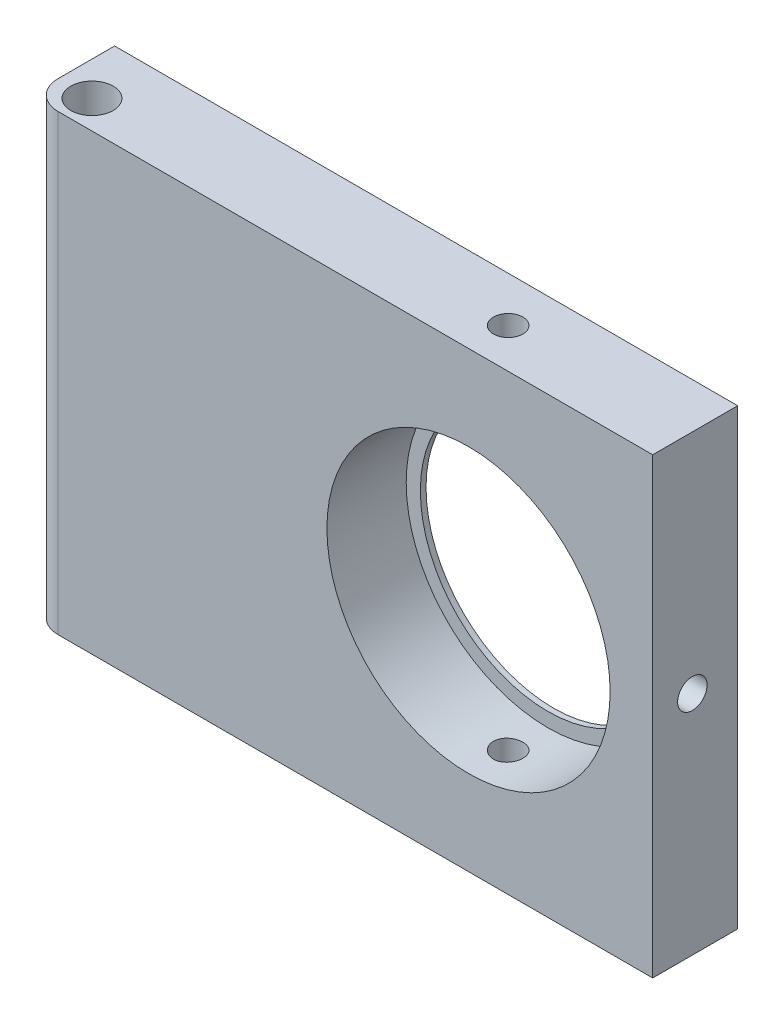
ISO-10303-21;
HEADER;
FILE_DESCRIPTION(('STEP AP214'),'2;1');
FILE_NAME('part.step','',(''),(''),'','','');
FILE_SCHEMA(('AUTOMOTIVE_DESIGN { 1 0 10303 214 1 1 1 1 }'));
ENDSEC;
DATA;
#1=APPLICATION_CONTEXT('core data for automotive mechanical design processes');
#2=APPLICATION_PROTOCOL_DEFINITION('international standard','automotive_design',2000,#1);
#3=PRODUCT_CONTEXT('',#1,'mechanical');
#4=PRODUCT('Part','Part','',(#3));
#5=PRODUCT_RELATED_PRODUCT_CATEGORY('part','',(#4));
#6=PRODUCT_DEFINITION_FORMATION('','',#4);
#7=PRODUCT_DEFINITION_CONTEXT('part definition',#1,'design');
#8=PRODUCT_DEFINITION('design','',#6,#7);
#9=PRODUCT_DEFINITION_SHAPE('','',#8);
#10=(LENGTH_UNIT() NAMED_UNIT(*) SI_UNIT(.MILLI.,.METRE.));
#11=(NAMED_UNIT(*) PLANE_ANGLE_UNIT() SI_UNIT($,.RADIAN.));
#12=(NAMED_UNIT(*) SI_UNIT($,.STERADIAN.) SOLID_ANGLE_UNIT());
#13=UNCERTAINTY_MEASURE_WITH_UNIT(LENGTH_MEASURE(1.E-05),#10,'distance_accuracy_value','');
#14=(GEOMETRIC_REPRESENTATION_CONTEXT(3) GLOBAL_UNCERTAINTY_ASSIGNED_CONTEXT((#13)) GLOBAL_UNIT_ASSIGNED_CONTEXT((#10,
#11,#12)) REPRESENTATION_CONTEXT('',''));
#15=CARTESIAN_POINT('',(0.,0.,0.));
#16=DIRECTION('',(0.,0.,1.));
#17=DIRECTION('',(1.,0.,0.));
#18=AXIS2_PLACEMENT_3D('',#15,#16,#17);
#19=CARTESIAN_POINT('',(-38.1,-25.4,9.525));
#20=DIRECTION('',(-1.,0.,0.));
#21=DIRECTION('',(0.,-1.,0.));
#22=AXIS2_PLACEMENT_3D('',#19,#20,#21);
#23=PLANE('',#22);
#24=DIRECTION('',(0.,0.,-1.));
#25=VECTOR('',#24,1.);
#26=CARTESIAN_POINT('',(-38.1,-25.4,9.525));
#27=LINE('',#26,#25);
#28=CARTESIAN_POINT('',(-38.1,-25.4,6.35));
#29=VERTEX_POINT('',#28);
#30=CARTESIAN_POINT('',(-38.1,-25.4,0.));
#31=VERTEX_POINT('',#30);
#32=EDGE_CURVE('E118',#29,#31,#27,.T.);
#33=ORIENTED_EDGE('',*,*,#32,.F.);
#34=DIRECTION('',(0.,1.,0.));
#35=VECTOR('',#34,1.);
#36=CARTESIAN_POINT('',(-38.1,-25.4,6.35));
#37=LINE('',#36,#35);
#38=CARTESIAN_POINT('',(-38.1,25.4,6.35));
#39=VERTEX_POINT('',#38);
#40=EDGE_CURVE('E87',#29,#39,#37,.T.);
#41=ORIENTED_EDGE('',*,*,#40,.T.);
#42=DIRECTION('',(0.,0.,-1.));
#43=VECTOR('',#42,1.);
#44=CARTESIAN_POINT('',(-38.1,25.4,9.525));
#45=LINE('',#44,#43);
#46=CARTESIAN_POINT('',(-38.1,25.4,0.));
#47=VERTEX_POINT('',#46);
#48=EDGE_CURVE('E81',#39,#47,#45,.T.);
#49=ORIENTED_EDGE('',*,*,#48,.T.);
#50=DIRECTION('',(0.,1.,0.));
#51=VECTOR('',#50,1.);
#52=CARTESIAN_POINT('',(-38.1,-25.4,0.));
#53=LINE('',#52,#51);
#54=EDGE_CURVE('E84',#31,#47,#53,.T.);
#55=ORIENTED_EDGE('',*,*,#54,.F.);
#56=EDGE_LOOP('',(#33,#41,#49,#55));
#57=FACE_BOUND('',#56,.T.);
#58=ADVANCED_FACE('F35',(#57),#23,.T.);
#59=CARTESIAN_POINT('',(-38.1,-25.4,9.525));
#60=DIRECTION('',(0.,1.,0.));
#61=DIRECTION('',(-1.,0.,0.));
#62=AXIS2_PLACEMENT_3D('',#59,#60,#61);
#63=PLANE('',#62);
#64=CARTESIAN_POINT('',(11.0998,-25.4,5.08));
#65=DIRECTION('',(0.,1.,0.));
#66=DIRECTION('',(-1.,0.,0.));
#67=AXIS2_PLACEMENT_3D('',#64,#65,#66);
#68=CIRCLE('',#67,1.651);
#69=CARTESIAN_POINT('',(9.44879999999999,-25.4,5.08));
#70=VERTEX_POINT('',#69);
#71=EDGE_CURVE('E129',#70,#70,#68,.T.);
#72=ORIENTED_EDGE('',*,*,#71,.T.);
#73=EDGE_LOOP('',(#72));
#74=FACE_BOUND('',#73,.T.);
#75=CARTESIAN_POINT('',(-34.29,-25.4,6.35));
#76=DIRECTION('',(0.,-1.,0.));
#77=DIRECTION('',(1.,0.,0.));
#78=AXIS2_PLACEMENT_3D('',#75,#76,#77);
#79=CIRCLE('',#78,2.3749);
#80=CARTESIAN_POINT('',(-31.9151,-25.4,6.35));
#81=VERTEX_POINT('',#80);
#82=EDGE_CURVE('E220',#81,#81,#79,.T.);
#83=ORIENTED_EDGE('',*,*,#82,.F.);
#84=EDGE_LOOP('',(#83));
#85=FACE_BOUND('',#84,.T.);
#86=DIRECTION('',(1.,0.,0.));
#87=VECTOR('',#86,1.);
#88=CARTESIAN_POINT('',(-38.1,-25.4,9.525));
#89=LINE('',#88,#87);
#90=CARTESIAN_POINT('',(-34.925,-25.4,9.525));
#91=VERTEX_POINT('',#90);
#92=CARTESIAN_POINT('',(31.75,-25.4,9.525));
#93=VERTEX_POINT('',#92);
#94=EDGE_CURVE('E90',#91,#93,#89,.T.);
#95=ORIENTED_EDGE('',*,*,#94,.F.);
#96=CARTESIAN_POINT('',(-34.925,-25.4,6.35));
#97=DIRECTION('',(0.,1.,0.));
#98=DIRECTION('',(-1.,0.,0.));
#99=AXIS2_PLACEMENT_3D('',#96,#97,#98);
#100=CIRCLE('',#99,3.175);
#101=EDGE_CURVE('E11',#91,#29,#100,.F.);
#102=ORIENTED_EDGE('',*,*,#101,.T.);
#103=ORIENTED_EDGE('',*,*,#32,.T.);
#104=DIRECTION('',(1.,0.,0.));
#105=VECTOR('',#104,1.);
#106=CARTESIAN_POINT('',(-38.1,-25.4,0.));
#107=LINE('',#106,#105);
#108=CARTESIAN_POINT('',(31.75,-25.4,0.));
#109=VERTEX_POINT('',#108);
#110=EDGE_CURVE('E99',#31,#109,#107,.T.);
#111=ORIENTED_EDGE('',*,*,#110,.T.);
#112=DIRECTION('',(0.,0.,-1.));
#113=VECTOR('',#112,1.);
#114=CARTESIAN_POINT('',(31.75,-25.4,9.525));
#115=LINE('',#114,#113);
#116=EDGE_CURVE('E116',#93,#109,#115,.T.);
#117=ORIENTED_EDGE('',*,*,#116,.F.);
#118=EDGE_LOOP('',(#95,#102,#103,#111,#117));
#119=FACE_BOUND('',#118,.T.);
#120=ADVANCED_FACE('F37',(#74,#85,#119),#63,.F.);
#121=CARTESIAN_POINT('',(31.75,25.4,9.525));
#122=DIRECTION('',(1.,0.,0.));
#123=DIRECTION('',(0.,1.,0.));
#124=AXIS2_PLACEMENT_3D('',#121,#122,#123);
#125=PLANE('',#124);
#126=CARTESIAN_POINT('',(31.75,0.,5.08));
#127=DIRECTION('',(1.,0.,0.));
#128=DIRECTION('',(0.,1.,0.));
#129=AXIS2_PLACEMENT_3D('',#126,#127,#128);
#130=CIRCLE('',#129,1.651);
#131=CARTESIAN_POINT('',(31.75,1.65100000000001,5.08));
#132=VERTEX_POINT('',#131);
#133=EDGE_CURVE('E215',#132,#132,#130,.T.);
#134=ORIENTED_EDGE('',*,*,#133,.F.);
#135=EDGE_LOOP('',(#134));
#136=FACE_BOUND('',#135,.T.);
#137=DIRECTION('',(0.,0.,-1.));
#138=VECTOR('',#137,1.);
#139=CARTESIAN_POINT('',(31.75,25.4,9.525));
#140=LINE('',#139,#138);
#141=CARTESIAN_POINT('',(31.75,25.4,9.525));
#142=VERTEX_POINT('',#141);
#143=CARTESIAN_POINT('',(31.75,25.4,0.));
#144=VERTEX_POINT('',#143);
#145=EDGE_CURVE('E89',#142,#144,#140,.T.);
#146=ORIENTED_EDGE('',*,*,#145,.F.);
#147=DIRECTION('',(0.,-1.,0.));
#148=VECTOR('',#147,1.);
#149=CARTESIAN_POINT('',(31.75,25.4,9.525));
#150=LINE('',#149,#148);
#151=EDGE_CURVE('E111',#142,#93,#150,.T.);
#152=ORIENTED_EDGE('',*,*,#151,.T.);
#153=ORIENTED_EDGE('',*,*,#116,.T.);
#154=DIRECTION('',(0.,-1.,0.));
#155=VECTOR('',#154,1.);
#156=CARTESIAN_POINT('',(31.75,25.4,0.));
#157=LINE('',#156,#155);
#158=EDGE_CURVE('E103',#144,#109,#157,.T.);
#159=ORIENTED_EDGE('',*,*,#158,.F.);
#160=EDGE_LOOP('',(#146,#152,#153,#159));
#161=FACE_BOUND('',#160,.T.);
#162=ADVANCED_FACE('F173',(#136,#161),#125,.T.);
#163=CARTESIAN_POINT('',(31.75,25.4,9.525));
#164=DIRECTION('',(0.,-1.,0.));
#165=DIRECTION('',(1.,0.,0.));
#166=AXIS2_PLACEMENT_3D('',#163,#164,#165);
#167=PLANE('',#166);
#168=CARTESIAN_POINT('',(11.0998,25.4,5.08));
#169=DIRECTION('',(0.,1.,0.));
#170=DIRECTION('',(-1.,0.,0.));
#171=AXIS2_PLACEMENT_3D('',#168,#169,#170);
#172=CIRCLE('',#171,1.651);
#173=CARTESIAN_POINT('',(9.44880000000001,25.4,5.08));
#174=VERTEX_POINT('',#173);
#175=EDGE_CURVE('E214',#174,#174,#172,.T.);
#176=ORIENTED_EDGE('',*,*,#175,.F.);
#177=EDGE_LOOP('',(#176));
#178=FACE_BOUND('',#177,.T.);
#179=CARTESIAN_POINT('',(-34.29,25.4,6.35));
#180=DIRECTION('',(0.,-1.,0.));
#181=DIRECTION('',(1.,0.,0.));
#182=AXIS2_PLACEMENT_3D('',#179,#180,#181);
#183=CIRCLE('',#182,2.3749);
#184=CARTESIAN_POINT('',(-31.9151,25.4,6.35));
#185=VERTEX_POINT('',#184);
#186=EDGE_CURVE('E223',#185,#185,#183,.T.);
#187=ORIENTED_EDGE('',*,*,#186,.T.);
#188=EDGE_LOOP('',(#187));
#189=FACE_BOUND('',#188,.T.);
#190=ORIENTED_EDGE('',*,*,#48,.F.);
#191=CARTESIAN_POINT('',(-34.925,25.4,6.35));
#192=DIRECTION('',(0.,-1.,0.));
#193=DIRECTION('',(1.,0.,0.));
#194=AXIS2_PLACEMENT_3D('',#191,#192,#193);
#195=CIRCLE('',#194,3.175);
#196=CARTESIAN_POINT('',(-34.925,25.4,9.525));
#197=VERTEX_POINT('',#196);
#198=EDGE_CURVE('E57',#39,#197,#195,.F.);
#199=ORIENTED_EDGE('',*,*,#198,.T.);
#200=DIRECTION('',(-1.,0.,0.));
#201=VECTOR('',#200,1.);
#202=CARTESIAN_POINT('',(31.75,25.4,9.525));
#203=LINE('',#202,#201);
#204=EDGE_CURVE('E109',#142,#197,#203,.T.);
#205=ORIENTED_EDGE('',*,*,#204,.F.);
#206=ORIENTED_EDGE('',*,*,#145,.T.);
#207=DIRECTION('',(-1.,0.,0.));
#208=VECTOR('',#207,1.);
#209=CARTESIAN_POINT('',(31.75,25.4,0.));
#210=LINE('',#209,#208);
#211=EDGE_CURVE('E96',#144,#47,#210,.T.);
#212=ORIENTED_EDGE('',*,*,#211,.T.);
#213=EDGE_LOOP('',(#190,#199,#205,#206,#212));
#214=FACE_BOUND('',#213,.T.);
#215=ADVANCED_FACE('F102',(#178,#189,#214),#167,.F.);
#216=CARTESIAN_POINT('',(-38.1,25.4,9.525));
#217=DIRECTION('',(0.,0.,1.));
#218=DIRECTION('',(1.,0.,0.));
#219=AXIS2_PLACEMENT_3D('',#216,#217,#218);
#220=PLANE('',#219);
#221=CARTESIAN_POINT('',(11.0998,0.,9.525));
#222=DIRECTION('',(0.,0.,1.));
#223=DIRECTION('',(1.,0.,0.));
#224=AXIS2_PLACEMENT_3D('',#221,#222,#223);
#225=CIRCLE('',#224,15.875);
#226=CARTESIAN_POINT('',(26.9748,0.,9.525));
#227=VERTEX_POINT('',#226);
#228=EDGE_CURVE('E191',#227,#227,#225,.T.);
#229=ORIENTED_EDGE('',*,*,#228,.F.);
#230=EDGE_LOOP('',(#229));
#231=FACE_BOUND('',#230,.T.);
#232=ORIENTED_EDGE('',*,*,#204,.T.);
#233=DIRECTION('',(0.,1.,0.));
#234=VECTOR('',#233,1.);
#235=CARTESIAN_POINT('',(-34.925,25.4,9.525));
#236=LINE('',#235,#234);
#237=EDGE_CURVE('E43',#197,#91,#236,.F.);
#238=ORIENTED_EDGE('',*,*,#237,.T.);
#239=ORIENTED_EDGE('',*,*,#94,.T.);
#240=ORIENTED_EDGE('',*,*,#151,.F.);
#241=EDGE_LOOP('',(#232,#238,#239,#240));
#242=FACE_BOUND('',#241,.T.);
#243=ADVANCED_FACE('F166',(#231,#242),#220,.T.);
#244=CARTESIAN_POINT('',(-38.1,25.4,0.));
#245=DIRECTION('',(0.,0.,1.));
#246=DIRECTION('',(1.,0.,0.));
#247=AXIS2_PLACEMENT_3D('',#244,#245,#246);
#248=PLANE('',#247);
#249=CARTESIAN_POINT('',(11.0998,0.,0.));
#250=DIRECTION('',(0.,0.,1.));
#251=DIRECTION('',(1.,0.,0.));
#252=AXIS2_PLACEMENT_3D('',#249,#250,#251);
#253=CIRCLE('',#252,14.2875);
#254=CARTESIAN_POINT('',(25.3873,0.,0.));
#255=VERTEX_POINT('',#254);
#256=EDGE_CURVE('E229',#255,#255,#253,.T.);
#257=ORIENTED_EDGE('',*,*,#256,.T.);
#258=EDGE_LOOP('',(#257));
#259=FACE_BOUND('',#258,.T.);
#260=ORIENTED_EDGE('',*,*,#54,.T.);
#261=ORIENTED_EDGE('',*,*,#211,.F.);
#262=ORIENTED_EDGE('',*,*,#158,.T.);
#263=ORIENTED_EDGE('',*,*,#110,.F.);
#264=EDGE_LOOP('',(#260,#261,#262,#263));
#265=FACE_BOUND('',#264,.T.);
#266=ADVANCED_FACE('F94',(#259,#265),#248,.F.);
#267=CARTESIAN_POINT('',(11.0998,0.,0.635000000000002));
#268=DIRECTION('',(0.,0.,1.));
#269=DIRECTION('',(1.,0.,0.));
#270=AXIS2_PLACEMENT_3D('',#267,#268,#269);
#271=CYLINDRICAL_SURFACE('',#270,15.875);
#272=CARTESIAN_POINT('',(26.8887145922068,1.65100000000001,5.08));
#273=CARTESIAN_POINT('',(26.8887157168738,1.65099600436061,4.98753205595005));
#274=CARTESIAN_POINT('',(26.8895356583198,1.64320551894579,4.89500345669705));
#275=CARTESIAN_POINT('',(26.8927262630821,1.61224621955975,4.71251305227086));
#276=CARTESIAN_POINT('',(26.8950986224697,1.58906058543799,4.62255416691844));
#277=CARTESIAN_POINT('',(26.9011225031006,1.52799466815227,4.44787226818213));
#278=CARTESIAN_POINT('',(26.9047732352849,1.49012344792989,4.36314606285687));
#279=CARTESIAN_POINT('',(26.9129415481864,1.40077910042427,4.20127051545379));
#280=CARTESIAN_POINT('',(26.9174589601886,1.34930861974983,4.12411970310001));
#281=CARTESIAN_POINT('',(26.9268714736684,1.23401012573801,3.97926454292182));
#282=CARTESIAN_POINT('',(26.9317678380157,1.17013961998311,3.91159409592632));
#283=CARTESIAN_POINT('',(26.9413751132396,1.03194505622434,3.78791264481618));
#284=CARTESIAN_POINT('',(26.9460860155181,0.957620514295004,3.73190218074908));
#285=CARTESIAN_POINT('',(26.9548041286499,0.80041907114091,3.63301269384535));
#286=CARTESIAN_POINT('',(26.9588097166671,0.717523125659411,3.59016378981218));
#287=CARTESIAN_POINT('',(26.9656521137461,0.545664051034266,3.51900646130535));
#288=CARTESIAN_POINT('',(26.9684889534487,0.456701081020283,3.49069765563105));
#289=CARTESIAN_POINT('',(26.972665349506,0.275576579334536,3.44952385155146));
#290=CARTESIAN_POINT('',(26.9740103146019,0.183427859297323,3.43660305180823));
#291=CARTESIAN_POINT('',(26.9750698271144,-0.00173930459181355,3.42639933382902));
#292=CARTESIAN_POINT('',(26.9747844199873,-0.0947577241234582,3.4291159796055));
#293=CARTESIAN_POINT('',(26.9726197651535,-0.278644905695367,3.45006482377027));
#294=CARTESIAN_POINT('',(26.9707466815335,-0.369520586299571,3.4682370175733));
#295=CARTESIAN_POINT('',(26.9656242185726,-0.546925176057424,3.51948759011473));
#296=CARTESIAN_POINT('',(26.9623748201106,-0.633454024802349,3.55256617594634));
#297=CARTESIAN_POINT('',(26.9548544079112,-0.799897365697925,3.63275605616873));
#298=CARTESIAN_POINT('',(26.9505814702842,-0.879799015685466,3.6798938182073));
#299=CARTESIAN_POINT('',(26.9414932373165,-1.0305797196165,3.78684475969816));
#300=CARTESIAN_POINT('',(26.9366779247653,-1.10145848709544,3.84665834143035));
#301=CARTESIAN_POINT('',(26.9270182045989,-1.23253305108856,3.97760030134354));
#302=CARTESIAN_POINT('',(26.9221737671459,-1.29267669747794,4.04878089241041));
#303=CARTESIAN_POINT('',(26.9130245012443,-1.40016979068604,4.20025553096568));
#304=CARTESIAN_POINT('',(26.9087196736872,-1.44751921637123,4.28054959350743));
#305=CARTESIAN_POINT('',(26.9011367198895,-1.52808000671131,4.4480129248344));
#306=CARTESIAN_POINT('',(26.8978588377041,-1.56128801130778,4.53518382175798));
#307=CARTESIAN_POINT('',(26.8927059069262,-1.61258131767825,4.71390592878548));
#308=CARTESIAN_POINT('',(26.890830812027,-1.63066711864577,4.80545699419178));
#309=CARTESIAN_POINT('',(26.8887038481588,-1.65113525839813,4.98988241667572));
#310=CARTESIAN_POINT('',(26.8884444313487,-1.65359061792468,5.08274858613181));
#311=CARTESIAN_POINT('',(26.8895582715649,-1.64292007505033,5.26757022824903));
#312=CARTESIAN_POINT('',(26.8909315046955,-1.62979440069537,5.35952571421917));
#313=CARTESIAN_POINT('',(26.8951490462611,-1.58839552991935,5.53970199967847));
#314=CARTESIAN_POINT('',(26.8979899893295,-1.56015698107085,5.62793084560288));
#315=CARTESIAN_POINT('',(26.9048201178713,-1.48936936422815,5.79839970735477));
#316=CARTESIAN_POINT('',(26.9088093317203,-1.44681994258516,5.88063957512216));
#317=CARTESIAN_POINT('',(26.9175047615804,-1.34843597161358,6.03712846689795));
#318=CARTESIAN_POINT('',(26.9222135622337,-1.29255310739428,6.11134696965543));
#319=CARTESIAN_POINT('',(26.931809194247,-1.16915767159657,6.24937655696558));
#320=CARTESIAN_POINT('',(26.9366960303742,-1.10164478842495,6.31318736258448));
#321=CARTESIAN_POINT('',(26.9461199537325,-0.95658865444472,6.42884269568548));
#322=CARTESIAN_POINT('',(26.9506556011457,-0.879007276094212,6.48063953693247));
#323=CARTESIAN_POINT('',(26.9588450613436,-0.716204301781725,6.5704682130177));
#324=CARTESIAN_POINT('',(26.9624988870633,-0.630982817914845,6.60850024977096));
#325=CARTESIAN_POINT('',(26.9685065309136,-0.45548404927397,6.66963922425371));
#326=CARTESIAN_POINT('',(26.970862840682,-0.365216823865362,6.69277478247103));
#327=CARTESIAN_POINT('',(26.9740202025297,-0.182053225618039,6.72355743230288));
#328=CARTESIAN_POINT('',(26.9748213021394,-0.0891569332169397,6.73120499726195));
#329=CARTESIAN_POINT('',(26.9747779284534,0.0961598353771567,6.73078760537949));
#330=CARTESIAN_POINT('',(26.973941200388,0.188580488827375,6.72279660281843));
#331=CARTESIAN_POINT('',(26.9707314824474,0.370758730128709,6.69148421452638));
#332=CARTESIAN_POINT('',(26.9683584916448,0.460516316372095,6.66816281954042));
#333=CARTESIAN_POINT('',(26.9623420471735,0.634818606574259,6.60687255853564));
#334=CARTESIAN_POINT('',(26.9586987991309,0.719364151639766,6.56890606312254));
#335=CARTESIAN_POINT('',(26.950547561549,0.880894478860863,6.47941114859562));
#336=CARTESIAN_POINT('',(26.946039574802,0.957879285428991,6.42788277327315));
#337=CARTESIAN_POINT('',(26.9366381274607,1.10248172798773,6.3124498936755));
#338=CARTESIAN_POINT('',(26.9317430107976,1.17005528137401,6.24849030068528));
#339=CARTESIAN_POINT('',(26.9221329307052,1.29354262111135,6.11012048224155));
#340=CARTESIAN_POINT('',(26.9174180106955,1.34945361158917,6.03570775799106));
#341=CARTESIAN_POINT('',(26.9086884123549,1.44815099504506,5.87831976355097));
#342=CARTESIAN_POINT('',(26.9046756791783,1.49090117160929,5.79532169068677));
#343=CARTESIAN_POINT('',(26.8978278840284,1.56180032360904,5.62333537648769));
#344=CARTESIAN_POINT('',(26.8949915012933,1.5899656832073,5.53435398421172));
#345=CARTESIAN_POINT('',(26.8915290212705,1.62391250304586,5.38406228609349));
#346=CARTESIAN_POINT('',(26.8904786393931,1.63405632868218,5.32371112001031));
#347=CARTESIAN_POINT('',(26.8890710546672,1.64760138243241,5.20224880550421));
#348=CARTESIAN_POINT('',(26.888713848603,1.65100264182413,5.14113766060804));
#349=CARTESIAN_POINT('',(26.8887145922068,1.65100000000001,5.08));
#350=B_SPLINE_CURVE_WITH_KNOTS('',3,(#272,#273,#274,#275,#276,#277,#278,#279,#280,#281,#282,
#283,#284,#285,#286,#287,#288,#289,#290,#291,#292,#293,#294,#295,#296,#297,#298,#299,#300,#301,
#302,#303,#304,#305,#306,#307,#308,#309,#310,#311,#312,#313,#314,#315,#316,#317,#318,#319,#320,
#321,#322,#323,#324,#325,#326,#327,#328,#329,#330,#331,#332,#333,#334,#335,#336,#337,#338,#339,
#340,#341,#342,#343,#344,#345,#346,#347,#348,#349),.UNSPECIFIED.,.T.,.F.,(4,2,2,2,2,2,2,2,2,2,2,
2,2,2,2,2,2,2,2,2,2,2,2,2,2,2,2,2,2,2,2,2,2,2,2,2,2,2,4),(0.,0.277180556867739,
0.554664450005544,0.831977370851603,1.10923636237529,1.3874627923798,1.66570210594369,
1.94457347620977,2.22343753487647,2.50128724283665,2.77912920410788,3.0558973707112,
3.33266938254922,3.60996576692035,3.8872709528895,4.16588862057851,4.44450674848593,
4.72319104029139,5.00186613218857,5.27923837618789,5.55660656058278,5.83334156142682,
6.11008340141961,6.3878436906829,6.66561142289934,6.94446350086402,7.22331148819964,
7.50162211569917,7.77992423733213,8.05691345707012,8.3339028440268,8.61084741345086,
8.88779108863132,9.16599123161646,9.44425799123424,9.72328378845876,10.0019954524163,
10.1852616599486,10.3685270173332),.UNSPECIFIED.);
#351=CARTESIAN_POINT('',(26.8887145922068,1.65100000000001,5.08));
#352=VERTEX_POINT('',#351);
#353=EDGE_CURVE('E207',#352,#352,#350,.T.);
#354=ORIENTED_EDGE('',*,*,#353,.F.);
#355=EDGE_LOOP('',(#354));
#356=FACE_BOUND('',#355,.T.);
#357=CARTESIAN_POINT('',(9.44879999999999,-15.7889145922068,5.08));
#358=CARTESIAN_POINT('',(9.44880399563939,-15.7889157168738,4.98753205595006));
#359=CARTESIAN_POINT('',(9.45659448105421,-15.7897356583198,4.89500345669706));
#360=CARTESIAN_POINT('',(9.48755378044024,-15.7929262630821,4.71251305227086));
#361=CARTESIAN_POINT('',(9.51073941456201,-15.7952986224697,4.62255416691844));
#362=CARTESIAN_POINT('',(9.57180533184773,-15.8013225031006,4.44787226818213));
#363=CARTESIAN_POINT('',(9.60967655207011,-15.8049732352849,4.36314606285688));
#364=CARTESIAN_POINT('',(9.69902089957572,-15.8131415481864,4.20127051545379));
#365=CARTESIAN_POINT('',(9.75049138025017,-15.8176589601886,4.12411970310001));
#366=CARTESIAN_POINT('',(9.86578987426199,-15.8270714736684,3.97926454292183));
#367=CARTESIAN_POINT('',(9.92966038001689,-15.8319678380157,3.91159409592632));
#368=CARTESIAN_POINT('',(10.0678549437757,-15.8415751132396,3.78791264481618));
#369=CARTESIAN_POINT('',(10.142179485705,-15.8462860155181,3.73190218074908));
#370=CARTESIAN_POINT('',(10.2993809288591,-15.8550041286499,3.63301269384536));
#371=CARTESIAN_POINT('',(10.3822768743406,-15.8590097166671,3.59016378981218));
#372=CARTESIAN_POINT('',(10.5541359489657,-15.8658521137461,3.51900646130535));
#373=CARTESIAN_POINT('',(10.6430989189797,-15.8686889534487,3.49069765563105));
#374=CARTESIAN_POINT('',(10.8242234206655,-15.8728653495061,3.44952385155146));
#375=CARTESIAN_POINT('',(10.9163721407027,-15.8742103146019,3.43660305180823));
#376=CARTESIAN_POINT('',(11.1015393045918,-15.8752698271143,3.42639933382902));
#377=CARTESIAN_POINT('',(11.1945577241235,-15.8749844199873,3.4291159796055));
#378=CARTESIAN_POINT('',(11.3784449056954,-15.8728197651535,3.45006482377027));
#379=CARTESIAN_POINT('',(11.4693205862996,-15.8709466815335,3.4682370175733));
#380=CARTESIAN_POINT('',(11.6467251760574,-15.8658242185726,3.51948759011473));
#381=CARTESIAN_POINT('',(11.7332540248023,-15.8625748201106,3.55256617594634));
#382=CARTESIAN_POINT('',(11.8996973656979,-15.8550544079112,3.63275605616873));
#383=CARTESIAN_POINT('',(11.9795990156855,-15.8507814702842,3.6798938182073));
#384=CARTESIAN_POINT('',(12.1303797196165,-15.8416932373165,3.78684475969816));
#385=CARTESIAN_POINT('',(12.2012584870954,-15.8368779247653,3.84665834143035));
#386=CARTESIAN_POINT('',(12.3323330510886,-15.8272182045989,3.97760030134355));
#387=CARTESIAN_POINT('',(12.3924766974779,-15.8223737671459,4.04878089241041));
#388=CARTESIAN_POINT('',(12.499969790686,-15.8132245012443,4.20025553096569));
#389=CARTESIAN_POINT('',(12.5473192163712,-15.8089196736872,4.28054959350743));
#390=CARTESIAN_POINT('',(12.6278800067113,-15.8013367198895,4.44801292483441));
#391=CARTESIAN_POINT('',(12.6610880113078,-15.798058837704,4.53518382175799));
#392=CARTESIAN_POINT('',(12.7123813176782,-15.7929059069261,4.71390592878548));
#393=CARTESIAN_POINT('',(12.7304671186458,-15.791030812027,4.80545699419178));
#394=CARTESIAN_POINT('',(12.7509352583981,-15.7889038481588,4.98988241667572));
#395=CARTESIAN_POINT('',(12.7533906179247,-15.7886444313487,5.08274858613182));
#396=CARTESIAN_POINT('',(12.7427200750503,-15.7897582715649,5.26757022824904));
#397=CARTESIAN_POINT('',(12.7295944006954,-15.7911315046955,5.35952571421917));
#398=CARTESIAN_POINT('',(12.6881955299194,-15.7953490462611,5.53970199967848));
#399=CARTESIAN_POINT('',(12.6599569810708,-15.7981899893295,5.62793084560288));
#400=CARTESIAN_POINT('',(12.5891693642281,-15.8050201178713,5.79839970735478));
#401=CARTESIAN_POINT('',(12.5466199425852,-15.8090093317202,5.88063957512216));
#402=CARTESIAN_POINT('',(12.4482359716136,-15.8177047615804,6.03712846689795));
#403=CARTESIAN_POINT('',(12.3923531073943,-15.8224135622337,6.11134696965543));
#404=CARTESIAN_POINT('',(12.2689576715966,-15.832009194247,6.24937655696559));
#405=CARTESIAN_POINT('',(12.201444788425,-15.8368960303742,6.31318736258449));
#406=CARTESIAN_POINT('',(12.0563886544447,-15.8463199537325,6.42884269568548));
#407=CARTESIAN_POINT('',(11.9788072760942,-15.8508556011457,6.48063953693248));
#408=CARTESIAN_POINT('',(11.8160043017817,-15.8590450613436,6.5704682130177));
#409=CARTESIAN_POINT('',(11.7307828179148,-15.8626988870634,6.60850024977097));
#410=CARTESIAN_POINT('',(11.555284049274,-15.8687065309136,6.66963922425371));
#411=CARTESIAN_POINT('',(11.4650168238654,-15.871062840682,6.69277478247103));
#412=CARTESIAN_POINT('',(11.281853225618,-15.8742202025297,6.72355743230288));
#413=CARTESIAN_POINT('',(11.1889569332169,-15.8750213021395,6.73120499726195));
#414=CARTESIAN_POINT('',(11.0036401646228,-15.8749779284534,6.73078760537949));
#415=CARTESIAN_POINT('',(10.9112195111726,-15.874141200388,6.72279660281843));
#416=CARTESIAN_POINT('',(10.7290412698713,-15.8709314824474,6.69148421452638));
#417=CARTESIAN_POINT('',(10.6392836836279,-15.8685584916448,6.66816281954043));
#418=CARTESIAN_POINT('',(10.4649813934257,-15.8625420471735,6.60687255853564));
#419=CARTESIAN_POINT('',(10.3804358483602,-15.8588987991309,6.56890606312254));
#420=CARTESIAN_POINT('',(10.2189055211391,-15.850747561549,6.47941114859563));
#421=CARTESIAN_POINT('',(10.141920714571,-15.846239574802,6.42788277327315));
#422=CARTESIAN_POINT('',(9.99731827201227,-15.8368381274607,6.3124498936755));
#423=CARTESIAN_POINT('',(9.92974471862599,-15.8319430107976,6.24849030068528));
#424=CARTESIAN_POINT('',(9.80625737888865,-15.8223329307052,6.11012048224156));
#425=CARTESIAN_POINT('',(9.75034638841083,-15.8176180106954,6.03570775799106));
#426=CARTESIAN_POINT('',(9.65164900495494,-15.8088884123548,5.87831976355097));
#427=CARTESIAN_POINT('',(9.60889882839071,-15.8048756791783,5.79532169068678));
#428=CARTESIAN_POINT('',(9.53799967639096,-15.7980278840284,5.62333537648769));
#429=CARTESIAN_POINT('',(9.50983431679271,-15.7951915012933,5.53435398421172));
#430=CARTESIAN_POINT('',(9.47588749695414,-15.7917290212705,5.38406228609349));
#431=CARTESIAN_POINT('',(9.46574367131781,-15.7906786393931,5.32371112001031));
#432=CARTESIAN_POINT('',(9.45219861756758,-15.7892710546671,5.20224880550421));
#433=CARTESIAN_POINT('',(9.44879735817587,-15.788913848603,5.14113766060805));
#434=CARTESIAN_POINT('',(9.44879999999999,-15.7889145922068,5.08));
#435=B_SPLINE_CURVE_WITH_KNOTS('',3,(#357,#358,#359,#360,#361,#362,#363,#364,#365,#366,#367,
#368,#369,#370,#371,#372,#373,#374,#375,#376,#377,#378,#379,#380,#381,#382,#383,#384,#385,#386,
#387,#388,#389,#390,#391,#392,#393,#394,#395,#396,#397,#398,#399,#400,#401,#402,#403,#404,#405,
#406,#407,#408,#409,#410,#411,#412,#413,#414,#415,#416,#417,#418,#419,#420,#421,#422,#423,#424,
#425,#426,#427,#428,#429,#430,#431,#432,#433,#434),.UNSPECIFIED.,.T.,.F.,(4,2,2,2,2,2,2,2,2,2,2,
2,2,2,2,2,2,2,2,2,2,2,2,2,2,2,2,2,2,2,2,2,2,2,2,2,2,2,4),(0.,0.277180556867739,
0.554664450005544,0.831977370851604,1.1092363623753,1.3874627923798,1.66570210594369,
1.94457347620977,2.22343753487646,2.50128724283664,2.77912920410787,3.0558973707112,
3.33266938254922,3.60996576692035,3.8872709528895,4.16588862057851,4.44450674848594,
4.72319104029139,5.00186613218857,5.27923837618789,5.55660656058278,5.83334156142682,
6.11008340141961,6.38784369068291,6.66561142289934,6.94446350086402,7.22331148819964,
7.50162211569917,7.77992423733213,8.05691345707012,8.3339028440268,8.61084741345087,
8.88779108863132,9.16599123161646,9.44425799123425,9.72328378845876,10.0019954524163,
10.1852616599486,10.3685270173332),.UNSPECIFIED.);
#436=CARTESIAN_POINT('',(9.44879999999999,-15.7889145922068,5.08));
#437=VERTEX_POINT('',#436);
#438=EDGE_CURVE('E128',#437,#437,#435,.T.);
#439=ORIENTED_EDGE('',*,*,#438,.T.);
#440=EDGE_LOOP('',(#439));
#441=FACE_BOUND('',#440,.T.);
#442=CARTESIAN_POINT('',(9.44879999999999,15.7889145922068,5.08));
#443=CARTESIAN_POINT('',(9.44880399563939,15.7889157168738,5.17246794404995));
#444=CARTESIAN_POINT('',(9.45659448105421,15.7897356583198,5.26499654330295));
#445=CARTESIAN_POINT('',(9.48755378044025,15.7929262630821,5.44748694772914));
#446=CARTESIAN_POINT('',(9.51073941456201,15.7952986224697,5.53744583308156));
#447=CARTESIAN_POINT('',(9.57180533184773,15.8013225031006,5.71212773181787));
#448=CARTESIAN_POINT('',(9.60967655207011,15.8049732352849,5.79685393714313));
#449=CARTESIAN_POINT('',(9.69902089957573,15.8131415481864,5.95872948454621));
#450=CARTESIAN_POINT('',(9.75049138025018,15.8176589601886,6.03588029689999));
#451=CARTESIAN_POINT('',(9.865789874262,15.8270714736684,6.18073545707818));
#452=CARTESIAN_POINT('',(9.9296603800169,15.8319678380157,6.24840590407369));
#453=CARTESIAN_POINT('',(10.0678549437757,15.8415751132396,6.37208735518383));
#454=CARTESIAN_POINT('',(10.142179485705,15.8462860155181,6.42809781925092));
#455=CARTESIAN_POINT('',(10.2993809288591,15.8550041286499,6.52698730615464));
#456=CARTESIAN_POINT('',(10.3822768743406,15.8590097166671,6.56983621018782));
#457=CARTESIAN_POINT('',(10.5541359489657,15.8658521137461,6.64099353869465));
#458=CARTESIAN_POINT('',(10.6430989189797,15.8686889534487,6.66930234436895));
#459=CARTESIAN_POINT('',(10.8242234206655,15.8728653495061,6.71047614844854));
#460=CARTESIAN_POINT('',(10.9163721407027,15.8742103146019,6.72339694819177));
#461=CARTESIAN_POINT('',(11.1015393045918,15.8752698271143,6.73360066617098));
#462=CARTESIAN_POINT('',(11.1945577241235,15.8749844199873,6.7308840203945));
#463=CARTESIAN_POINT('',(11.3784449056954,15.8728197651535,6.70993517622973));
#464=CARTESIAN_POINT('',(11.4693205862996,15.8709466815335,6.6917629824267));
#465=CARTESIAN_POINT('',(11.6467251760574,15.8658242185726,6.64051240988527));
#466=CARTESIAN_POINT('',(11.7332540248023,15.8625748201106,6.60743382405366));
#467=CARTESIAN_POINT('',(11.8996973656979,15.8550544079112,6.52724394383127));
#468=CARTESIAN_POINT('',(11.9795990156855,15.8507814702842,6.48010618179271));
#469=CARTESIAN_POINT('',(12.1303797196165,15.8416932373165,6.37315524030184));
#470=CARTESIAN_POINT('',(12.2012584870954,15.8368779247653,6.31334165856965));
#471=CARTESIAN_POINT('',(12.3323330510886,15.8272182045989,6.18239969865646));
#472=CARTESIAN_POINT('',(12.3924766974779,15.8223737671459,6.11121910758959));
#473=CARTESIAN_POINT('',(12.499969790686,15.8132245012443,5.95974446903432));
#474=CARTESIAN_POINT('',(12.5473192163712,15.8089196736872,5.87945040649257));
#475=CARTESIAN_POINT('',(12.6278800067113,15.8013367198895,5.7119870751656));
#476=CARTESIAN_POINT('',(12.6610880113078,15.7980588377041,5.62481617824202));
#477=CARTESIAN_POINT('',(12.7123813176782,15.7929059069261,5.44609407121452));
#478=CARTESIAN_POINT('',(12.7304671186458,15.791030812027,5.35454300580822));
#479=CARTESIAN_POINT('',(12.7509352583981,15.7889038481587,5.17011758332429));
#480=CARTESIAN_POINT('',(12.7533906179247,15.7886444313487,5.07725141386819));
#481=CARTESIAN_POINT('',(12.7427200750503,15.7897582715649,4.89242977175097));
#482=CARTESIAN_POINT('',(12.7295944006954,15.7911315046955,4.80047428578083));
#483=CARTESIAN_POINT('',(12.6881955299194,15.7953490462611,4.62029800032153));
#484=CARTESIAN_POINT('',(12.6599569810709,15.7981899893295,4.53206915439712));
#485=CARTESIAN_POINT('',(12.5891693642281,15.8050201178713,4.36160029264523));
#486=CARTESIAN_POINT('',(12.5466199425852,15.8090093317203,4.27936042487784));
#487=CARTESIAN_POINT('',(12.4482359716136,15.8177047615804,4.12287153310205));
#488=CARTESIAN_POINT('',(12.3923531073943,15.8224135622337,4.04865303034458));
#489=CARTESIAN_POINT('',(12.2689576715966,15.832009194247,3.91062344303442));
#490=CARTESIAN_POINT('',(12.201444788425,15.8368960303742,3.84681263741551));
#491=CARTESIAN_POINT('',(12.0563886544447,15.8463199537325,3.73115730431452));
#492=CARTESIAN_POINT('',(11.9788072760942,15.8508556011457,3.67936046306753));
#493=CARTESIAN_POINT('',(11.8160043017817,15.8590450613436,3.58953178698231));
#494=CARTESIAN_POINT('',(11.7307828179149,15.8626988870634,3.55149975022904));
#495=CARTESIAN_POINT('',(11.555284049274,15.8687065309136,3.49036077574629));
#496=CARTESIAN_POINT('',(11.4650168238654,15.871062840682,3.46722521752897));
#497=CARTESIAN_POINT('',(11.281853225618,15.8742202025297,3.43644256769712));
#498=CARTESIAN_POINT('',(11.1889569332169,15.8750213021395,3.42879500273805));
#499=CARTESIAN_POINT('',(11.0036401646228,15.8749779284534,3.42921239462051));
#500=CARTESIAN_POINT('',(10.9112195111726,15.874141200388,3.43720339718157));
#501=CARTESIAN_POINT('',(10.7290412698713,15.8709314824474,3.46851578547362));
#502=CARTESIAN_POINT('',(10.6392836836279,15.8685584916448,3.49183718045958));
#503=CARTESIAN_POINT('',(10.4649813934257,15.8625420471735,3.55312744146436));
#504=CARTESIAN_POINT('',(10.3804358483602,15.8588987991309,3.59109393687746));
#505=CARTESIAN_POINT('',(10.2189055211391,15.850747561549,3.68058885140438));
#506=CARTESIAN_POINT('',(10.141920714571,15.846239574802,3.73211722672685));
#507=CARTESIAN_POINT('',(9.99731827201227,15.8368381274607,3.8475501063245));
#508=CARTESIAN_POINT('',(9.92974471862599,15.8319430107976,3.91150969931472));
#509=CARTESIAN_POINT('',(9.80625737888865,15.8223329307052,4.04987951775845));
#510=CARTESIAN_POINT('',(9.75034638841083,15.8176180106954,4.12429224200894));
#511=CARTESIAN_POINT('',(9.65164900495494,15.8088884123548,4.28168023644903));
#512=CARTESIAN_POINT('',(9.60889882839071,15.8048756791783,4.36467830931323));
#513=CARTESIAN_POINT('',(9.53799967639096,15.7980278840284,4.53666462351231));
#514=CARTESIAN_POINT('',(9.5098343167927,15.7951915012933,4.62564601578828));
#515=CARTESIAN_POINT('',(9.47588749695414,15.7917290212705,4.77593771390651));
#516=CARTESIAN_POINT('',(9.46574367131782,15.7906786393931,4.83628887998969));
#517=CARTESIAN_POINT('',(9.45219861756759,15.7892710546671,4.95775119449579));
#518=CARTESIAN_POINT('',(9.44879735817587,15.788913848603,5.01886233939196));
#519=CARTESIAN_POINT('',(9.44879999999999,15.7889145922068,5.08));
#520=B_SPLINE_CURVE_WITH_KNOTS('',3,(#442,#443,#444,#445,#446,#447,#448,#449,#450,#451,#452,
#453,#454,#455,#456,#457,#458,#459,#460,#461,#462,#463,#464,#465,#466,#467,#468,#469,#470,#471,
#472,#473,#474,#475,#476,#477,#478,#479,#480,#481,#482,#483,#484,#485,#486,#487,#488,#489,#490,
#491,#492,#493,#494,#495,#496,#497,#498,#499,#500,#501,#502,#503,#504,#505,#506,#507,#508,#509,
#510,#511,#512,#513,#514,#515,#516,#517,#518,#519),.UNSPECIFIED.,.T.,.F.,(4,2,2,2,2,2,2,2,2,2,2,
2,2,2,2,2,2,2,2,2,2,2,2,2,2,2,2,2,2,2,2,2,2,2,2,2,2,2,4),(0.,0.27718055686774,0.554664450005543,
0.831977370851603,1.1092363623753,1.3874627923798,1.6657021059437,1.94457347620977,
2.22343753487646,2.50128724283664,2.77912920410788,3.0558973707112,3.33266938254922,
3.60996576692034,3.88727095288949,4.16588862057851,4.44450674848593,4.72319104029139,
5.00186613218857,5.27923837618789,5.55660656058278,5.83334156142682,6.11008340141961,
6.3878436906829,6.66561142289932,6.94446350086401,7.22331148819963,7.50162211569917,
7.77992423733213,8.05691345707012,8.3339028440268,8.61084741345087,8.88779108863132,
9.16599123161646,9.44425799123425,9.72328378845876,10.0019954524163,10.1852616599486,
10.3685270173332),.UNSPECIFIED.);
#521=CARTESIAN_POINT('',(9.44879999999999,15.7889145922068,5.08));
#522=VERTEX_POINT('',#521);
#523=EDGE_CURVE('E120',#522,#522,#520,.T.);
#524=ORIENTED_EDGE('',*,*,#523,.T.);
#525=EDGE_LOOP('',(#524));
#526=FACE_BOUND('',#525,.T.);
#527=CARTESIAN_POINT('',(11.0998,0.,0.635000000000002));
#528=DIRECTION('',(0.,0.,1.));
#529=DIRECTION('',(1.,0.,0.));
#530=AXIS2_PLACEMENT_3D('',#527,#528,#529);
#531=CIRCLE('',#530,15.875);
#532=CARTESIAN_POINT('',(26.9748,0.,0.635000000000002));
#533=VERTEX_POINT('',#532);
#534=EDGE_CURVE('E100',#533,#533,#531,.T.);
#535=ORIENTED_EDGE('',*,*,#534,.F.);
#536=EDGE_LOOP('',(#535));
#537=FACE_BOUND('',#536,.T.);
#538=ORIENTED_EDGE('',*,*,#228,.T.);
#539=EDGE_LOOP('',(#538));
#540=FACE_BOUND('',#539,.T.);
#541=ADVANCED_FACE('F134',(#356,#441,#526,#537,#540),#271,.F.);
#542=CARTESIAN_POINT('',(11.0998,0.,0.635000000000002));
#543=DIRECTION('',(0.,0.,1.));
#544=DIRECTION('',(1.,0.,0.));
#545=AXIS2_PLACEMENT_3D('',#542,#543,#544);
#546=PLANE('',#545);
#547=CARTESIAN_POINT('',(11.0998,0.,0.635000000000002));
#548=DIRECTION('',(0.,0.,1.));
#549=DIRECTION('',(1.,0.,0.));
#550=AXIS2_PLACEMENT_3D('',#547,#548,#549);
#551=CIRCLE('',#550,14.2875);
#552=CARTESIAN_POINT('',(25.3873,0.,0.635000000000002));
#553=VERTEX_POINT('',#552);
#554=EDGE_CURVE('E226',#553,#553,#551,.T.);
#555=ORIENTED_EDGE('',*,*,#554,.F.);
#556=EDGE_LOOP('',(#555));
#557=FACE_BOUND('',#556,.T.);
#558=ORIENTED_EDGE('',*,*,#534,.T.);
#559=EDGE_LOOP('',(#558));
#560=FACE_BOUND('',#559,.T.);
#561=ADVANCED_FACE('F155',(#557,#560),#546,.T.);
#562=CARTESIAN_POINT('',(11.0998,0.,0.));
#563=DIRECTION('',(0.,0.,1.));
#564=DIRECTION('',(1.,0.,0.));
#565=AXIS2_PLACEMENT_3D('',#562,#563,#564);
#566=CYLINDRICAL_SURFACE('',#565,14.2875);
#567=ORIENTED_EDGE('',*,*,#256,.F.);
#568=EDGE_LOOP('',(#567));
#569=FACE_BOUND('',#568,.T.);
#570=ORIENTED_EDGE('',*,*,#554,.T.);
#571=EDGE_LOOP('',(#570));
#572=FACE_BOUND('',#571,.T.);
#573=ADVANCED_FACE('F152',(#569,#572),#566,.F.);
#574=CARTESIAN_POINT('',(-34.29,25.4,6.35));
#575=DIRECTION('',(0.,-1.,0.));
#576=DIRECTION('',(1.,0.,0.));
#577=AXIS2_PLACEMENT_3D('',#574,#575,#576);
#578=CYLINDRICAL_SURFACE('',#577,2.3749);
#579=ORIENTED_EDGE('',*,*,#186,.F.);
#580=EDGE_LOOP('',(#579));
#581=FACE_BOUND('',#580,.T.);
#582=ORIENTED_EDGE('',*,*,#82,.T.);
#583=EDGE_LOOP('',(#582));
#584=FACE_BOUND('',#583,.T.);
#585=ADVANCED_FACE('F148',(#581,#584),#578,.F.);
#586=CARTESIAN_POINT('',(11.0998,-25.4,5.08));
#587=DIRECTION('',(0.,1.,0.));
#588=DIRECTION('',(-1.,0.,0.));
#589=AXIS2_PLACEMENT_3D('',#586,#587,#588);
#590=CYLINDRICAL_SURFACE('',#589,1.651);
#591=ORIENTED_EDGE('',*,*,#175,.T.);
#592=EDGE_LOOP('',(#591));
#593=FACE_BOUND('',#592,.T.);
#594=ORIENTED_EDGE('',*,*,#523,.F.);
#595=EDGE_LOOP('',(#594));
#596=FACE_BOUND('',#595,.T.);
#597=ADVANCED_FACE('F144',(#593,#596),#590,.F.);
#598=ORIENTED_EDGE('',*,*,#71,.F.);
#599=EDGE_LOOP('',(#598));
#600=FACE_BOUND('',#599,.T.);
#601=ORIENTED_EDGE('',*,*,#438,.F.);
#602=EDGE_LOOP('',(#601));
#603=FACE_BOUND('',#602,.T.);
#604=ADVANCED_FACE('F138',(#600,#603),#590,.F.);
#605=CARTESIAN_POINT('',(-38.101,0.,5.08));
#606=DIRECTION('',(1.,0.,0.));
#607=DIRECTION('',(0.,1.,0.));
#608=AXIS2_PLACEMENT_3D('',#605,#606,#607);
#609=CYLINDRICAL_SURFACE('',#608,1.651);
#610=ORIENTED_EDGE('',*,*,#133,.T.);
#611=EDGE_LOOP('',(#610));
#612=FACE_BOUND('',#611,.T.);
#613=ORIENTED_EDGE('',*,*,#353,.T.);
#614=EDGE_LOOP('',(#613));
#615=FACE_BOUND('',#614,.T.);
#616=ADVANCED_FACE('F143',(#612,#615),#609,.F.);
#617=CARTESIAN_POINT('',(-34.925,-25.4,6.35));
#618=DIRECTION('',(0.,1.,0.));
#619=DIRECTION('',(-1.,0.,0.));
#620=AXIS2_PLACEMENT_3D('',#617,#618,#619);
#621=CYLINDRICAL_SURFACE('',#620,3.175);
#622=ORIENTED_EDGE('',*,*,#101,.F.);
#623=ORIENTED_EDGE('',*,*,#237,.F.);
#624=ORIENTED_EDGE('',*,*,#198,.F.);
#625=ORIENTED_EDGE('',*,*,#40,.F.);
#626=EDGE_LOOP('',(#622,#623,#624,#625));
#627=FACE_BOUND('',#626,.T.);
#628=ADVANCED_FACE('F195',(#627),#621,.T.);
#629=CLOSED_SHELL('',(#58,#120,#162,#215,#243,#266,#541,#561,#573,#585,#597,#604,#616,#628));
#630=MANIFOLD_SOLID_BREP('B2',#629);
#631=ADVANCED_BREP_SHAPE_REPRESENTATION('',(#18,#630),#14);
#632=SHAPE_DEFINITION_REPRESENTATION(#9,#631);
ENDSEC;
END-ISO-10303-21;
